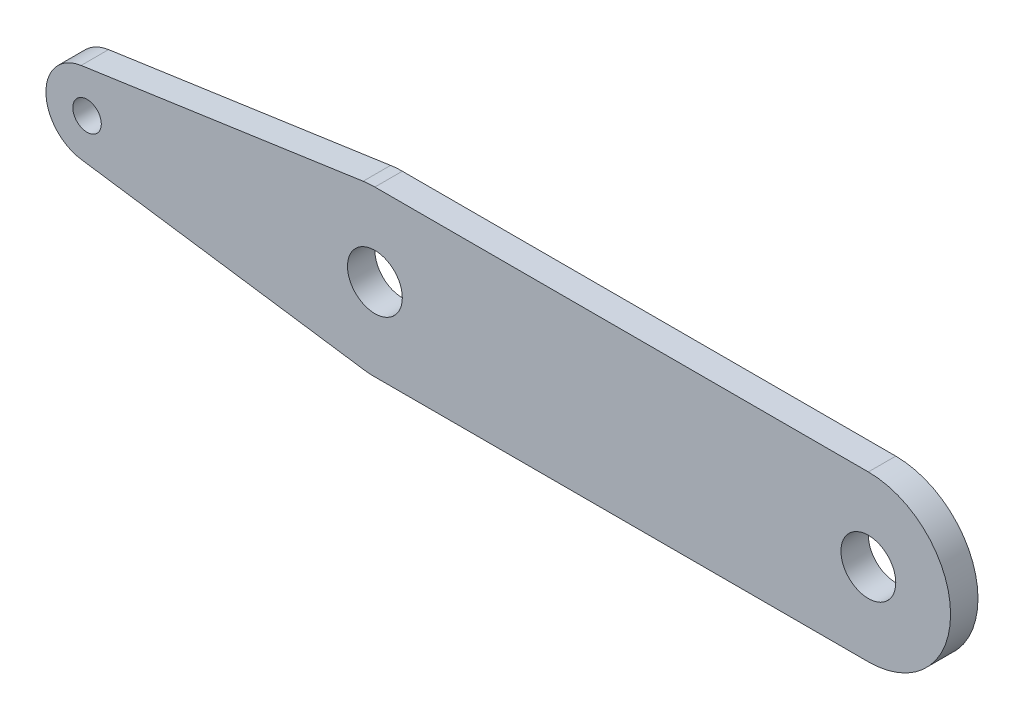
from build123d import *

# Parameters (mm, degrees)
SKETCH1_R           = 6.35
SKETCH1_R_2         = 3.302
BOSS_EXTRUDE1_DEPTH = 6.35


with BuildPart() as part:
    # Sketch1 → Boss-Extrude1 (new body)
    with BuildSketch(Plane.XY):
        with BuildLine():
            Line((-68.035714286, 9.42730511), (-2.721428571, 18.85461022))
            ThreePointArc((-2.721428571, 18.85461022), (-1.364216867, 19.001089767), (0, 19.05))
            Line((0, 19.05), (114.3, 19.05))
            ThreePointArc((114.3, 19.05), (133.35, 0), (114.3, -19.05))
            Line((114.3, -19.05), (0, -19.05))
            ThreePointArc((0, -19.05), (-1.364216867, -19.001089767), (-2.721428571, -18.85461022))
            Line((-2.721428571, -18.85461022), (-68.035714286, -9.42730511))
            ThreePointArc((-68.035714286, -9.42730511), (-76.2, 0), (-68.035714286, 9.42730511))
        make_face()
        Circle(SKETCH1_R, mode=Mode.SUBTRACT)
        with Locations((114.3, 0)):
            Circle(SKETCH1_R, mode=Mode.SUBTRACT)
        with Locations((-66.675, 0)):
            Circle(SKETCH1_R_2, mode=Mode.SUBTRACT)
    extrude(amount=BOSS_EXTRUDE1_DEPTH)


solid = part.part
